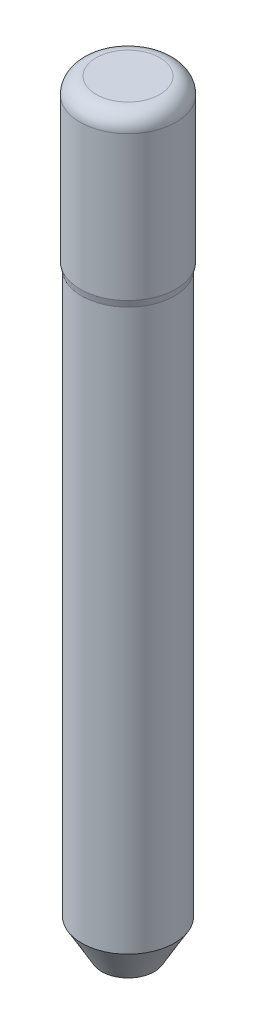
ISO-10303-21;
HEADER;
FILE_DESCRIPTION(('STEP AP214'),'2;1');
FILE_NAME('part.step','',(''),(''),'','','');
FILE_SCHEMA(('AUTOMOTIVE_DESIGN { 1 0 10303 214 1 1 1 1 }'));
ENDSEC;
DATA;
#1=APPLICATION_CONTEXT('core data for automotive mechanical design processes');
#2=APPLICATION_PROTOCOL_DEFINITION('international standard','automotive_design',2000,#1);
#3=PRODUCT_CONTEXT('',#1,'mechanical');
#4=PRODUCT('Part','Part','',(#3));
#5=PRODUCT_RELATED_PRODUCT_CATEGORY('part','',(#4));
#6=PRODUCT_DEFINITION_FORMATION('','',#4);
#7=PRODUCT_DEFINITION_CONTEXT('part definition',#1,'design');
#8=PRODUCT_DEFINITION('design','',#6,#7);
#9=PRODUCT_DEFINITION_SHAPE('','',#8);
#10=(LENGTH_UNIT() NAMED_UNIT(*) SI_UNIT(.MILLI.,.METRE.));
#11=(NAMED_UNIT(*) PLANE_ANGLE_UNIT() SI_UNIT($,.RADIAN.));
#12=(NAMED_UNIT(*) SI_UNIT($,.STERADIAN.) SOLID_ANGLE_UNIT());
#13=UNCERTAINTY_MEASURE_WITH_UNIT(LENGTH_MEASURE(1.E-05),#10,'distance_accuracy_value','');
#14=(GEOMETRIC_REPRESENTATION_CONTEXT(3) GLOBAL_UNCERTAINTY_ASSIGNED_CONTEXT((#13)) GLOBAL_UNIT_ASSIGNED_CONTEXT((#10,
#11,#12)) REPRESENTATION_CONTEXT('',''));
#15=CARTESIAN_POINT('',(0.,0.,0.));
#16=DIRECTION('',(0.,0.,1.));
#17=DIRECTION('',(1.,0.,0.));
#18=AXIS2_PLACEMENT_3D('',#15,#16,#17);
#19=CARTESIAN_POINT('',(0.,0.,0.));
#20=DIRECTION('',(0.,-1.,0.));
#21=DIRECTION('',(0.,0.,-1.));
#22=AXIS2_PLACEMENT_3D('',#19,#20,#21);
#23=PLANE('',#22);
#24=CARTESIAN_POINT('',(0.,0.,0.));
#25=DIRECTION('',(0.,-1.,0.));
#26=DIRECTION('',(0.,0.,-1.));
#27=AXIS2_PLACEMENT_3D('',#24,#25,#26);
#28=CIRCLE('',#27,0.984444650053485);
#29=CARTESIAN_POINT('',(0.,0.,-0.984444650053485));
#30=VERTEX_POINT('',#29);
#31=EDGE_CURVE('E10',#30,#30,#28,.T.);
#32=ORIENTED_EDGE('',*,*,#31,.T.);
#33=EDGE_LOOP('',(#32));
#34=FACE_BOUND('',#33,.T.);
#35=ADVANCED_FACE('F35',(#34),#23,.T.);
#36=CARTESIAN_POINT('',(0.,0.,0.));
#37=DIRECTION('',(0.,1.,0.));
#38=DIRECTION('',(0.,0.,1.));
#39=AXIS2_PLACEMENT_3D('',#36,#37,#38);
#40=CONICAL_SURFACE('',#39,0.984444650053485,0.5235987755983);
#41=CARTESIAN_POINT('',(0.,1.3,0.));
#42=DIRECTION('',(0.,-1.,0.));
#43=DIRECTION('',(0.,0.,-1.));
#44=AXIS2_PLACEMENT_3D('',#41,#42,#43);
#45=CIRCLE('',#44,1.735);
#46=CARTESIAN_POINT('',(0.,1.3,-1.735));
#47=VERTEX_POINT('',#46);
#48=EDGE_CURVE('E41',#47,#47,#45,.T.);
#49=ORIENTED_EDGE('',*,*,#48,.T.);
#50=EDGE_LOOP('',(#49));
#51=FACE_BOUND('',#50,.T.);
#52=ORIENTED_EDGE('',*,*,#31,.F.);
#53=EDGE_LOOP('',(#52));
#54=FACE_BOUND('',#53,.T.);
#55=ADVANCED_FACE('F73',(#51,#54),#40,.T.);
#56=CARTESIAN_POINT('',(0.,0.,0.));
#57=DIRECTION('',(0.,-1.,0.));
#58=DIRECTION('',(0.,0.,-1.));
#59=AXIS2_PLACEMENT_3D('',#56,#57,#58);
#60=CYLINDRICAL_SURFACE('',#59,1.735);
#61=CARTESIAN_POINT('',(0.,22.246,0.));
#62=DIRECTION('',(0.,-1.,0.));
#63=DIRECTION('',(0.,0.,-1.));
#64=AXIS2_PLACEMENT_3D('',#61,#62,#63);
#65=CIRCLE('',#64,1.735);
#66=CARTESIAN_POINT('',(0.,22.246,-1.735));
#67=VERTEX_POINT('',#66);
#68=EDGE_CURVE('E45',#67,#67,#65,.T.);
#69=ORIENTED_EDGE('',*,*,#68,.T.);
#70=EDGE_LOOP('',(#69));
#71=FACE_BOUND('',#70,.T.);
#72=ORIENTED_EDGE('',*,*,#48,.F.);
#73=EDGE_LOOP('',(#72));
#74=FACE_BOUND('',#73,.T.);
#75=ADVANCED_FACE('F77',(#71,#74),#60,.T.);
#76=CARTESIAN_POINT('',(0.,22.246,0.));
#77=DIRECTION('',(0.,1.,0.));
#78=DIRECTION('',(0.,0.,1.));
#79=AXIS2_PLACEMENT_3D('',#76,#77,#78);
#80=CONICAL_SURFACE('',#79,1.735,0.213243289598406);
#81=CARTESIAN_POINT('',(0.,22.5,0.));
#82=DIRECTION('',(0.,-1.,0.));
#83=DIRECTION('',(0.,0.,-1.));
#84=AXIS2_PLACEMENT_3D('',#81,#82,#83);
#85=CIRCLE('',#84,1.79);
#86=CARTESIAN_POINT('',(0.,22.5,-1.79));
#87=VERTEX_POINT('',#86);
#88=EDGE_CURVE('E49',#87,#87,#85,.T.);
#89=ORIENTED_EDGE('',*,*,#88,.T.);
#90=EDGE_LOOP('',(#89));
#91=FACE_BOUND('',#90,.T.);
#92=ORIENTED_EDGE('',*,*,#68,.F.);
#93=EDGE_LOOP('',(#92));
#94=FACE_BOUND('',#93,.T.);
#95=ADVANCED_FACE('F81',(#91,#94),#80,.T.);
#96=CARTESIAN_POINT('',(0.,0.,0.));
#97=DIRECTION('',(0.,-1.,0.));
#98=DIRECTION('',(0.,0.,-1.));
#99=AXIS2_PLACEMENT_3D('',#96,#97,#98);
#100=CYLINDRICAL_SURFACE('',#99,1.79);
#101=CARTESIAN_POINT('',(0.,27.9,0.));
#102=DIRECTION('',(0.,-1.,0.));
#103=DIRECTION('',(0.,0.,-1.));
#104=AXIS2_PLACEMENT_3D('',#101,#102,#103);
#105=CIRCLE('',#104,1.79);
#106=CARTESIAN_POINT('',(0.,27.9,-1.79));
#107=VERTEX_POINT('',#106);
#108=EDGE_CURVE('E54',#107,#107,#105,.T.);
#109=ORIENTED_EDGE('',*,*,#108,.T.);
#110=EDGE_LOOP('',(#109));
#111=FACE_BOUND('',#110,.T.);
#112=ORIENTED_EDGE('',*,*,#88,.F.);
#113=EDGE_LOOP('',(#112));
#114=FACE_BOUND('',#113,.T.);
#115=ADVANCED_FACE('F70',(#111,#114),#100,.T.);
#116=CARTESIAN_POINT('',(0.,27.9,0.));
#117=DIRECTION('',(0.,-1.,0.));
#118=DIRECTION('',(0.,0.,-1.));
#119=AXIS2_PLACEMENT_3D('',#116,#117,#118);
#120=TOROIDAL_SURFACE('',#119,1.19,0.6);
#121=CARTESIAN_POINT('',(0.,28.5,0.));
#122=DIRECTION('',(0.,-1.,0.));
#123=DIRECTION('',(0.,0.,-1.));
#124=AXIS2_PLACEMENT_3D('',#121,#122,#123);
#125=CIRCLE('',#124,1.19);
#126=CARTESIAN_POINT('',(0.,28.5,-1.19));
#127=VERTEX_POINT('',#126);
#128=EDGE_CURVE('E57',#127,#127,#125,.T.);
#129=ORIENTED_EDGE('',*,*,#128,.T.);
#130=EDGE_LOOP('',(#129));
#131=FACE_BOUND('',#130,.T.);
#132=ORIENTED_EDGE('',*,*,#108,.F.);
#133=EDGE_LOOP('',(#132));
#134=FACE_BOUND('',#133,.T.);
#135=ADVANCED_FACE('F61',(#131,#134),#120,.T.);
#136=CARTESIAN_POINT('',(1.19,28.5,0.));
#137=DIRECTION('',(0.,1.,0.));
#138=DIRECTION('',(0.,0.,1.));
#139=AXIS2_PLACEMENT_3D('',#136,#137,#138);
#140=PLANE('',#139);
#141=ORIENTED_EDGE('',*,*,#128,.F.);
#142=EDGE_LOOP('',(#141));
#143=FACE_BOUND('',#142,.T.);
#144=ADVANCED_FACE('F64',(#143),#140,.T.);
#145=CLOSED_SHELL('',(#35,#55,#75,#95,#115,#135,#144));
#146=MANIFOLD_SOLID_BREP('B2',#145);
#147=ADVANCED_BREP_SHAPE_REPRESENTATION('',(#18,#146),#14);
#148=SHAPE_DEFINITION_REPRESENTATION(#9,#147);
ENDSEC;
END-ISO-10303-21;
